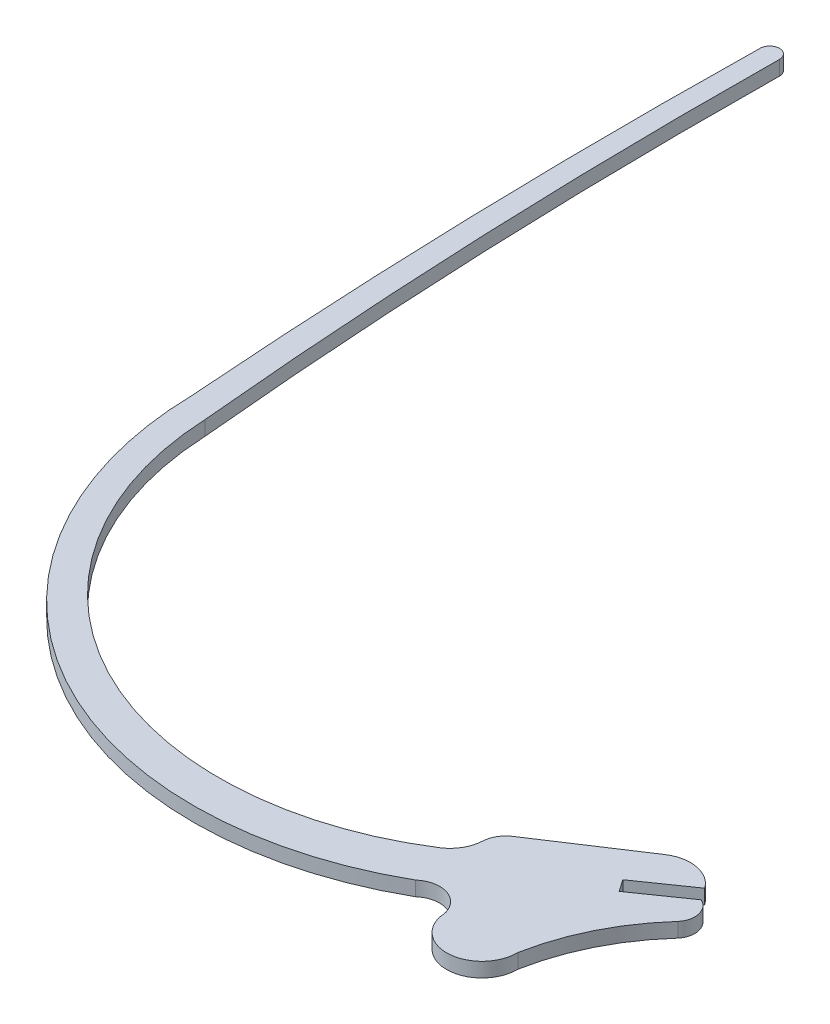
ISO-10303-21;
HEADER;
FILE_DESCRIPTION(('STEP AP214'),'2;1');
FILE_NAME('part.step','',(''),(''),'','','');
FILE_SCHEMA(('AUTOMOTIVE_DESIGN { 1 0 10303 214 1 1 1 1 }'));
ENDSEC;
DATA;
#1=APPLICATION_CONTEXT('core data for automotive mechanical design processes');
#2=APPLICATION_PROTOCOL_DEFINITION('international standard','automotive_design',2000,#1);
#3=PRODUCT_CONTEXT('',#1,'mechanical');
#4=PRODUCT('Part','Part','',(#3));
#5=PRODUCT_RELATED_PRODUCT_CATEGORY('part','',(#4));
#6=PRODUCT_DEFINITION_FORMATION('','',#4);
#7=PRODUCT_DEFINITION_CONTEXT('part definition',#1,'design');
#8=PRODUCT_DEFINITION('design','',#6,#7);
#9=PRODUCT_DEFINITION_SHAPE('','',#8);
#10=(LENGTH_UNIT() NAMED_UNIT(*) SI_UNIT(.MILLI.,.METRE.));
#11=(NAMED_UNIT(*) PLANE_ANGLE_UNIT() SI_UNIT($,.RADIAN.));
#12=(NAMED_UNIT(*) SI_UNIT($,.STERADIAN.) SOLID_ANGLE_UNIT());
#13=UNCERTAINTY_MEASURE_WITH_UNIT(LENGTH_MEASURE(1.E-05),#10,'distance_accuracy_value','');
#14=(GEOMETRIC_REPRESENTATION_CONTEXT(3) GLOBAL_UNCERTAINTY_ASSIGNED_CONTEXT((#13)) GLOBAL_UNIT_ASSIGNED_CONTEXT((#10,
#11,#12)) REPRESENTATION_CONTEXT('',''));
#15=CARTESIAN_POINT('',(0.,0.,0.));
#16=DIRECTION('',(0.,0.,1.));
#17=DIRECTION('',(1.,0.,0.));
#18=AXIS2_PLACEMENT_3D('',#15,#16,#17);
#19=CARTESIAN_POINT('',(-41670.167335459,3.,-18203.6307407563));
#20=DIRECTION('',(0.,-1.,0.));
#21=DIRECTION('',(0.,0.,-1.));
#22=AXIS2_PLACEMENT_3D('',#19,#20,#21);
#23=CYLINDRICAL_SURFACE('',#22,7.45711301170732);
#24=CARTESIAN_POINT('',(-41670.167335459,0.,-18203.6307407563));
#25=DIRECTION('',(0.,1.,0.));
#26=DIRECTION('',(0.,0.,1.));
#27=AXIS2_PLACEMENT_3D('',#24,#25,#26);
#28=CIRCLE('',#27,7.45711301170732);
#29=CARTESIAN_POINT('',(-41664.097656,0.,-18207.962891));
#30=VERTEX_POINT('',#29);
#31=CARTESIAN_POINT('',(-41674.261719,0.,-18209.863281));
#32=VERTEX_POINT('',#31);
#33=EDGE_CURVE('E186',#30,#32,#28,.T.);
#34=ORIENTED_EDGE('',*,*,#33,.T.);
#35=DIRECTION('',(0.,-1.,0.));
#36=VECTOR('',#35,1.);
#37=CARTESIAN_POINT('',(-41674.261719,3.,-18209.863281));
#38=LINE('',#37,#36);
#39=CARTESIAN_POINT('',(-41674.261719,3.,-18209.863281));
#40=VERTEX_POINT('',#39);
#41=EDGE_CURVE('E11',#40,#32,#38,.T.);
#42=ORIENTED_EDGE('',*,*,#41,.F.);
#43=CARTESIAN_POINT('',(-41670.167335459,3.,-18203.6307407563));
#44=DIRECTION('',(0.,1.,0.));
#45=DIRECTION('',(0.,0.,1.));
#46=AXIS2_PLACEMENT_3D('',#43,#44,#45);
#47=CIRCLE('',#46,7.45711301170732);
#48=CARTESIAN_POINT('',(-41664.097656,3.,-18207.962891));
#49=VERTEX_POINT('',#48);
#50=EDGE_CURVE('E218',#49,#40,#47,.T.);
#51=ORIENTED_EDGE('',*,*,#50,.F.);
#52=DIRECTION('',(0.,-1.,0.));
#53=VECTOR('',#52,1.);
#54=CARTESIAN_POINT('',(-41664.097656,3.,-18207.962891));
#55=LINE('',#54,#53);
#56=EDGE_CURVE('E182',#49,#30,#55,.T.);
#57=ORIENTED_EDGE('',*,*,#56,.T.);
#58=EDGE_LOOP('',(#34,#42,#51,#57));
#59=FACE_BOUND('',#58,.T.);
#60=ADVANCED_FACE('F36',(#59),#23,.T.);
#61=CARTESIAN_POINT('',(-41693.266504,3.,-18197.371175));
#62=DIRECTION('',(0.549277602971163,0.,0.835639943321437));
#63=DIRECTION('',(0.835639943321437,0.,-0.549277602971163));
#64=AXIS2_PLACEMENT_3D('',#61,#62,#63);
#65=PLANE('',#64);
#66=DIRECTION('',(-0.835639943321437,0.,0.549277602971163));
#67=VECTOR('',#66,1.);
#68=CARTESIAN_POINT('',(-41693.266504,0.,-18197.371175));
#69=LINE('',#68,#67);
#70=CARTESIAN_POINT('',(-41693.266504,0.,-18197.3711750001));
#71=VERTEX_POINT('',#70);
#72=EDGE_CURVE('E189',#32,#71,#69,.T.);
#73=ORIENTED_EDGE('',*,*,#72,.T.);
#74=DIRECTION('',(0.,-1.,0.));
#75=VECTOR('',#74,1.);
#76=CARTESIAN_POINT('',(-41693.266504,3.,-18197.3711750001));
#77=LINE('',#76,#75);
#78=CARTESIAN_POINT('',(-41693.266504,3.,-18197.3711750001));
#79=VERTEX_POINT('',#78);
#80=EDGE_CURVE('E44',#79,#71,#77,.T.);
#81=ORIENTED_EDGE('',*,*,#80,.F.);
#82=DIRECTION('',(-0.835639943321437,0.,0.549277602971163));
#83=VECTOR('',#82,1.);
#84=CARTESIAN_POINT('',(-41693.266504,3.,-18197.371175));
#85=LINE('',#84,#83);
#86=EDGE_CURVE('E122',#40,#79,#85,.T.);
#87=ORIENTED_EDGE('',*,*,#86,.F.);
#88=ORIENTED_EDGE('',*,*,#41,.T.);
#89=EDGE_LOOP('',(#73,#81,#87,#88));
#90=FACE_BOUND('',#89,.T.);
#91=ADVANCED_FACE('F321',(#90),#65,.F.);
#92=CARTESIAN_POINT('',(-41690.5203135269,3.,-18193.1919860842));
#93=DIRECTION('',(0.,-1.,0.));
#94=DIRECTION('',(0.,0.,-1.));
#95=AXIS2_PLACEMENT_3D('',#92,#93,#94);
#96=CYLINDRICAL_SURFACE('',#95,5.00071815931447);
#97=CARTESIAN_POINT('',(-41690.5203135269,0.,-18193.1919860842));
#98=DIRECTION('',(0.,1.,0.));
#99=DIRECTION('',(0.,0.,1.));
#100=AXIS2_PLACEMENT_3D('',#97,#98,#99);
#101=CIRCLE('',#100,5.00071815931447);
#102=CARTESIAN_POINT('',(-41695.515589,0.,-18193.425235));
#103=VERTEX_POINT('',#102);
#104=EDGE_CURVE('E191',#71,#103,#101,.T.);
#105=ORIENTED_EDGE('',*,*,#104,.T.);
#106=DIRECTION('',(0.,-1.,0.));
#107=VECTOR('',#106,1.);
#108=CARTESIAN_POINT('',(-41695.515589,3.,-18193.425235));
#109=LINE('',#108,#107);
#110=CARTESIAN_POINT('',(-41695.515589,3.,-18193.425235));
#111=VERTEX_POINT('',#110);
#112=EDGE_CURVE('E252',#111,#103,#109,.T.);
#113=ORIENTED_EDGE('',*,*,#112,.F.);
#114=CARTESIAN_POINT('',(-41690.5203135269,3.,-18193.1919860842));
#115=DIRECTION('',(0.,1.,0.));
#116=DIRECTION('',(0.,0.,1.));
#117=AXIS2_PLACEMENT_3D('',#114,#115,#116);
#118=CIRCLE('',#117,5.00071815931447);
#119=EDGE_CURVE('E260',#79,#111,#118,.T.);
#120=ORIENTED_EDGE('',*,*,#119,.F.);
#121=ORIENTED_EDGE('',*,*,#80,.T.);
#122=EDGE_LOOP('',(#105,#113,#120,#121));
#123=FACE_BOUND('',#122,.T.);
#124=ADVANCED_FACE('F258',(#123),#96,.T.);
#125=CARTESIAN_POINT('',(-41702.5818313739,3.,-18193.7542508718));
#126=DIRECTION('',(0.,-1.,0.));
#127=DIRECTION('',(0.,0.,-1.));
#128=AXIS2_PLACEMENT_3D('',#125,#126,#127);
#129=CYLINDRICAL_SURFACE('',#128,7.07389798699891);
#130=CARTESIAN_POINT('',(-41702.5818313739,0.,-18193.7542508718));
#131=DIRECTION('',(0.,-1.,0.));
#132=DIRECTION('',(0.,0.,1.));
#133=AXIS2_PLACEMENT_3D('',#130,#131,#132);
#134=CIRCLE('',#133,7.07389798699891);
#135=CARTESIAN_POINT('',(-41698.7770929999,0.,-18187.790695));
#136=VERTEX_POINT('',#135);
#137=EDGE_CURVE('E193',#103,#136,#134,.T.);
#138=ORIENTED_EDGE('',*,*,#137,.T.);
#139=DIRECTION('',(0.,-1.,0.));
#140=VECTOR('',#139,1.);
#141=CARTESIAN_POINT('',(-41698.7770929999,3.,-18187.790695));
#142=LINE('',#141,#140);
#143=CARTESIAN_POINT('',(-41698.7770929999,3.,-18187.790695));
#144=VERTEX_POINT('',#143);
#145=EDGE_CURVE('E249',#144,#136,#142,.T.);
#146=ORIENTED_EDGE('',*,*,#145,.F.);
#147=CARTESIAN_POINT('',(-41702.5818313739,3.,-18193.7542508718));
#148=DIRECTION('',(0.,-1.,0.));
#149=DIRECTION('',(0.,0.,1.));
#150=AXIS2_PLACEMENT_3D('',#147,#148,#149);
#151=CIRCLE('',#150,7.07389798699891);
#152=EDGE_CURVE('E278',#111,#144,#151,.T.);
#153=ORIENTED_EDGE('',*,*,#152,.F.);
#154=ORIENTED_EDGE('',*,*,#112,.T.);
#155=EDGE_LOOP('',(#138,#146,#153,#154));
#156=FACE_BOUND('',#155,.T.);
#157=ADVANCED_FACE('F269',(#156),#129,.F.);
#158=CARTESIAN_POINT('',(-41734.1210727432,3.,-18243.1972549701));
#159=DIRECTION('',(0.,-1.,0.));
#160=DIRECTION('',(0.,0.,-1.));
#161=AXIS2_PLACEMENT_3D('',#158,#159,#160);
#162=CYLINDRICAL_SURFACE('',#161,65.7197366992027);
#163=CARTESIAN_POINT('',(-41734.1210727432,0.,-18243.1972549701));
#164=DIRECTION('',(0.,-1.,0.));
#165=DIRECTION('',(0.,0.,1.));
#166=AXIS2_PLACEMENT_3D('',#163,#164,#165);
#167=CIRCLE('',#166,65.7197366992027);
#168=CARTESIAN_POINT('',(-41799.7722559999,0.,-18240.1962669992));
#169=VERTEX_POINT('',#168);
#170=EDGE_CURVE('E195',#136,#169,#167,.T.);
#171=ORIENTED_EDGE('',*,*,#170,.T.);
#172=DIRECTION('',(0.,-1.,0.));
#173=VECTOR('',#172,1.);
#174=CARTESIAN_POINT('',(-41799.7722559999,3.,-18240.1962669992));
#175=LINE('',#174,#173);
#176=CARTESIAN_POINT('',(-41799.7722559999,3.,-18240.1962669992));
#177=VERTEX_POINT('',#176);
#178=EDGE_CURVE('E246',#177,#169,#175,.T.);
#179=ORIENTED_EDGE('',*,*,#178,.F.);
#180=CARTESIAN_POINT('',(-41734.1210727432,3.,-18243.1972549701));
#181=DIRECTION('',(0.,-1.,0.));
#182=DIRECTION('',(0.,0.,1.));
#183=AXIS2_PLACEMENT_3D('',#180,#181,#182);
#184=CIRCLE('',#183,65.7197366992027);
#185=EDGE_CURVE('E275',#144,#177,#184,.T.);
#186=ORIENTED_EDGE('',*,*,#185,.F.);
#187=ORIENTED_EDGE('',*,*,#145,.T.);
#188=EDGE_LOOP('',(#171,#179,#186,#187));
#189=FACE_BOUND('',#188,.T.);
#190=ADVANCED_FACE('F273',(#189),#162,.F.);
#191=CARTESIAN_POINT('',(-40643.9922011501,3.,-18349.9280772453));
#192=DIRECTION('',(0.,-1.,0.));
#193=DIRECTION('',(0.,0.,-1.));
#194=AXIS2_PLACEMENT_3D('',#191,#192,#193);
#195=CYLINDRICAL_SURFACE('',#194,1160.97743534);
#196=CARTESIAN_POINT('',(-40643.9922011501,0.,-18349.9280772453));
#197=DIRECTION('',(0.,-1.,0.));
#198=DIRECTION('',(0.,0.,1.));
#199=AXIS2_PLACEMENT_3D('',#196,#197,#198);
#200=CIRCLE('',#199,1160.97743534);
#201=CARTESIAN_POINT('',(-41804.882129,0.,-18364.182227));
#202=VERTEX_POINT('',#201);
#203=EDGE_CURVE('E197',#169,#202,#200,.T.);
#204=ORIENTED_EDGE('',*,*,#203,.T.);
#205=DIRECTION('',(0.,-1.,0.));
#206=VECTOR('',#205,1.);
#207=CARTESIAN_POINT('',(-41804.882129,3.,-18364.182227));
#208=LINE('',#207,#206);
#209=CARTESIAN_POINT('',(-41804.882129,3.,-18364.182227));
#210=VERTEX_POINT('',#209);
#211=EDGE_CURVE('E243',#210,#202,#208,.T.);
#212=ORIENTED_EDGE('',*,*,#211,.F.);
#213=CARTESIAN_POINT('',(-40643.9922011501,3.,-18349.9280772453));
#214=DIRECTION('',(0.,-1.,0.));
#215=DIRECTION('',(0.,0.,1.));
#216=AXIS2_PLACEMENT_3D('',#213,#214,#215);
#217=CIRCLE('',#216,1160.97743534);
#218=EDGE_CURVE('E277',#177,#210,#217,.T.);
#219=ORIENTED_EDGE('',*,*,#218,.F.);
#220=ORIENTED_EDGE('',*,*,#178,.T.);
#221=EDGE_LOOP('',(#204,#212,#219,#220));
#222=FACE_BOUND('',#221,.T.);
#223=ADVANCED_FACE('F334',(#222),#195,.F.);
#224=CARTESIAN_POINT('',(-41806.879844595,3.,-18364.2070715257));
#225=DIRECTION('',(0.,-1.,0.));
#226=DIRECTION('',(0.,0.,-1.));
#227=AXIS2_PLACEMENT_3D('',#224,#225,#226);
#228=CYLINDRICAL_SURFACE('',#227,1.99787007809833);
#229=CARTESIAN_POINT('',(-41806.879844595,0.,-18364.2070715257));
#230=DIRECTION('',(0.,1.,0.));
#231=DIRECTION('',(0.,0.,1.));
#232=AXIS2_PLACEMENT_3D('',#229,#230,#231);
#233=CIRCLE('',#232,1.99787007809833);
#234=CARTESIAN_POINT('',(-41808.872267,0.,-18364.354509));
#235=VERTEX_POINT('',#234);
#236=EDGE_CURVE('E199',#202,#235,#233,.T.);
#237=ORIENTED_EDGE('',*,*,#236,.T.);
#238=DIRECTION('',(0.,-1.,0.));
#239=VECTOR('',#238,1.);
#240=CARTESIAN_POINT('',(-41808.872267,3.,-18364.354509));
#241=LINE('',#240,#239);
#242=CARTESIAN_POINT('',(-41808.872267,3.,-18364.354509));
#243=VERTEX_POINT('',#242);
#244=EDGE_CURVE('E240',#243,#235,#241,.T.);
#245=ORIENTED_EDGE('',*,*,#244,.F.);
#246=CARTESIAN_POINT('',(-41806.879844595,3.,-18364.2070715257));
#247=DIRECTION('',(0.,1.,0.));
#248=DIRECTION('',(0.,0.,1.));
#249=AXIS2_PLACEMENT_3D('',#246,#247,#248);
#250=CIRCLE('',#249,1.99787007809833);
#251=EDGE_CURVE('E280',#210,#243,#250,.T.);
#252=ORIENTED_EDGE('',*,*,#251,.F.);
#253=ORIENTED_EDGE('',*,*,#211,.T.);
#254=EDGE_LOOP('',(#237,#245,#252,#253));
#255=FACE_BOUND('',#254,.T.);
#256=ADVANCED_FACE('F337',(#255),#228,.T.);
#257=CARTESIAN_POINT('',(-40509.0392705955,3.,-18340.4780748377));
#258=DIRECTION('',(0.,-1.,0.));
#259=DIRECTION('',(0.,0.,-1.));
#260=AXIS2_PLACEMENT_3D('',#257,#258,#259);
#261=CYLINDRICAL_SURFACE('',#260,1300.0522691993);
#262=CARTESIAN_POINT('',(-40509.0392705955,0.,-18340.4780748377));
#263=DIRECTION('',(0.,1.,0.));
#264=DIRECTION('',(0.,0.,1.));
#265=AXIS2_PLACEMENT_3D('',#262,#263,#264);
#266=CIRCLE('',#265,1300.0522691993);
#267=CARTESIAN_POINT('',(-41805.442287,0.,-18243.1378379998));
#268=VERTEX_POINT('',#267);
#269=EDGE_CURVE('E201',#235,#268,#266,.T.);
#270=ORIENTED_EDGE('',*,*,#269,.T.);
#271=DIRECTION('',(0.,-1.,0.));
#272=VECTOR('',#271,1.);
#273=CARTESIAN_POINT('',(-41805.442287,3.,-18243.1378379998));
#274=LINE('',#273,#272);
#275=CARTESIAN_POINT('',(-41805.442287,3.,-18243.1378379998));
#276=VERTEX_POINT('',#275);
#277=EDGE_CURVE('E237',#276,#268,#274,.T.);
#278=ORIENTED_EDGE('',*,*,#277,.F.);
#279=CARTESIAN_POINT('',(-40509.0392705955,3.,-18340.4780748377));
#280=DIRECTION('',(0.,1.,0.));
#281=DIRECTION('',(0.,0.,1.));
#282=AXIS2_PLACEMENT_3D('',#279,#280,#281);
#283=CIRCLE('',#282,1300.0522691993);
#284=EDGE_CURVE('E286',#243,#276,#283,.T.);
#285=ORIENTED_EDGE('',*,*,#284,.F.);
#286=ORIENTED_EDGE('',*,*,#244,.T.);
#287=EDGE_LOOP('',(#270,#278,#285,#286));
#288=FACE_BOUND('',#287,.T.);
#289=ADVANCED_FACE('F341',(#288),#261,.T.);
#290=CARTESIAN_POINT('',(-41729.0621741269,3.,-18244.5690325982));
#291=DIRECTION('',(0.,-1.,0.));
#292=DIRECTION('',(0.,0.,-1.));
#293=AXIS2_PLACEMENT_3D('',#290,#291,#292);
#294=CYLINDRICAL_SURFACE('',#293,76.3935204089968);
#295=CARTESIAN_POINT('',(-41729.0621741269,0.,-18244.5690325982));
#296=DIRECTION('',(0.,1.,0.));
#297=DIRECTION('',(0.,0.,1.));
#298=AXIS2_PLACEMENT_3D('',#295,#296,#297);
#299=CIRCLE('',#298,76.3935204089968);
#300=CARTESIAN_POINT('',(-41796.8202680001,0.,-18209.2871580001));
#301=VERTEX_POINT('',#300);
#302=EDGE_CURVE('E203',#268,#301,#299,.T.);
#303=ORIENTED_EDGE('',*,*,#302,.T.);
#304=DIRECTION('',(0.,-1.,0.));
#305=VECTOR('',#304,1.);
#306=CARTESIAN_POINT('',(-41796.8202680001,3.,-18209.2871580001));
#307=LINE('',#306,#305);
#308=CARTESIAN_POINT('',(-41796.8202680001,3.,-18209.2871580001));
#309=VERTEX_POINT('',#308);
#310=EDGE_CURVE('E234',#309,#301,#307,.T.);
#311=ORIENTED_EDGE('',*,*,#310,.F.);
#312=CARTESIAN_POINT('',(-41729.0621741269,3.,-18244.5690325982));
#313=DIRECTION('',(0.,1.,0.));
#314=DIRECTION('',(0.,0.,1.));
#315=AXIS2_PLACEMENT_3D('',#312,#313,#314);
#316=CIRCLE('',#315,76.3935204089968);
#317=EDGE_CURVE('E288',#276,#309,#316,.T.);
#318=ORIENTED_EDGE('',*,*,#317,.F.);
#319=ORIENTED_EDGE('',*,*,#277,.T.);
#320=EDGE_LOOP('',(#303,#311,#318,#319));
#321=FACE_BOUND('',#320,.T.);
#322=ADVANCED_FACE('F345',(#321),#294,.T.);
#323=CARTESIAN_POINT('',(-41731.8291687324,3.,-18243.1292127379));
#324=DIRECTION('',(0.,-1.,0.));
#325=DIRECTION('',(0.,0.,-1.));
#326=AXIS2_PLACEMENT_3D('',#323,#324,#325);
#327=CYLINDRICAL_SURFACE('',#326,73.2743314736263);
#328=CARTESIAN_POINT('',(-41731.8291687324,0.,-18243.1292127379));
#329=DIRECTION('',(0.,1.,0.));
#330=DIRECTION('',(0.,0.,1.));
#331=AXIS2_PLACEMENT_3D('',#328,#329,#330);
#332=CIRCLE('',#331,73.2743314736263);
#333=CARTESIAN_POINT('',(-41695.481924,0.,-18179.5052749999));
#334=VERTEX_POINT('',#333);
#335=EDGE_CURVE('E205',#301,#334,#332,.T.);
#336=ORIENTED_EDGE('',*,*,#335,.T.);
#337=DIRECTION('',(0.,-1.,0.));
#338=VECTOR('',#337,1.);
#339=CARTESIAN_POINT('',(-41695.481924,3.,-18179.5052749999));
#340=LINE('',#339,#338);
#341=CARTESIAN_POINT('',(-41695.481924,3.,-18179.5052749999));
#342=VERTEX_POINT('',#341);
#343=EDGE_CURVE('E231',#342,#334,#340,.T.);
#344=ORIENTED_EDGE('',*,*,#343,.F.);
#345=CARTESIAN_POINT('',(-41731.8291687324,3.,-18243.1292127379));
#346=DIRECTION('',(0.,1.,0.));
#347=DIRECTION('',(0.,0.,1.));
#348=AXIS2_PLACEMENT_3D('',#345,#346,#347);
#349=CIRCLE('',#348,73.2743314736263);
#350=EDGE_CURVE('E290',#309,#342,#349,.T.);
#351=ORIENTED_EDGE('',*,*,#350,.F.);
#352=ORIENTED_EDGE('',*,*,#310,.T.);
#353=EDGE_LOOP('',(#336,#344,#351,#352));
#354=FACE_BOUND('',#353,.T.);
#355=ADVANCED_FACE('F349',(#354),#327,.T.);
#356=CARTESIAN_POINT('',(-41691.8619260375,3.,-18175.3744133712));
#357=DIRECTION('',(0.,-1.,0.));
#358=DIRECTION('',(0.,0.,-1.));
#359=AXIS2_PLACEMENT_3D('',#356,#357,#358);
#360=CYLINDRICAL_SURFACE('',#359,5.49257708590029);
#361=CARTESIAN_POINT('',(-41691.8619260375,0.,-18175.3744133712));
#362=DIRECTION('',(0.,-1.,0.));
#363=DIRECTION('',(0.,0.,1.));
#364=AXIS2_PLACEMENT_3D('',#361,#362,#363);
#365=CIRCLE('',#364,5.49257708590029);
#366=CARTESIAN_POINT('',(-41686.3725320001,0.,-18175.561379));
#367=VERTEX_POINT('',#366);
#368=EDGE_CURVE('E207',#334,#367,#365,.T.);
#369=ORIENTED_EDGE('',*,*,#368,.T.);
#370=DIRECTION('',(0.,-1.,0.));
#371=VECTOR('',#370,1.);
#372=CARTESIAN_POINT('',(-41686.3725320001,3.,-18175.561379));
#373=LINE('',#372,#371);
#374=CARTESIAN_POINT('',(-41686.3725320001,3.,-18175.561379));
#375=VERTEX_POINT('',#374);
#376=EDGE_CURVE('E228',#375,#367,#373,.T.);
#377=ORIENTED_EDGE('',*,*,#376,.F.);
#378=CARTESIAN_POINT('',(-41691.8619260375,3.,-18175.3744133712));
#379=DIRECTION('',(0.,-1.,0.));
#380=DIRECTION('',(0.,0.,1.));
#381=AXIS2_PLACEMENT_3D('',#378,#379,#380);
#382=CIRCLE('',#381,5.49257708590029);
#383=EDGE_CURVE('E292',#342,#375,#382,.T.);
#384=ORIENTED_EDGE('',*,*,#383,.F.);
#385=ORIENTED_EDGE('',*,*,#343,.T.);
#386=EDGE_LOOP('',(#369,#377,#384,#385));
#387=FACE_BOUND('',#386,.T.);
#388=ADVANCED_FACE('F353',(#387),#360,.F.);
#389=CARTESIAN_POINT('',(-41679.2044723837,3.,-18176.9783732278));
#390=DIRECTION('',(0.,-1.,0.));
#391=DIRECTION('',(0.,0.,-1.));
#392=AXIS2_PLACEMENT_3D('',#389,#390,#391);
#393=CYLINDRICAL_SURFACE('',#392,7.30677434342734);
#394=CARTESIAN_POINT('',(-41679.2044723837,0.,-18176.9783732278));
#395=DIRECTION('',(0.,1.,0.));
#396=DIRECTION('',(0.,0.,1.));
#397=AXIS2_PLACEMENT_3D('',#394,#395,#396);
#398=CIRCLE('',#397,7.30677434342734);
#399=CARTESIAN_POINT('',(-41671.89863,0.,-18177.095071));
#400=VERTEX_POINT('',#399);
#401=EDGE_CURVE('E209',#367,#400,#398,.T.);
#402=ORIENTED_EDGE('',*,*,#401,.T.);
#403=DIRECTION('',(0.,-1.,0.));
#404=VECTOR('',#403,1.);
#405=CARTESIAN_POINT('',(-41671.89863,3.,-18177.095071));
#406=LINE('',#405,#404);
#407=CARTESIAN_POINT('',(-41671.89863,3.,-18177.095071));
#408=VERTEX_POINT('',#407);
#409=EDGE_CURVE('E225',#408,#400,#406,.T.);
#410=ORIENTED_EDGE('',*,*,#409,.F.);
#411=CARTESIAN_POINT('',(-41679.2044723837,3.,-18176.9783732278));
#412=DIRECTION('',(0.,1.,0.));
#413=DIRECTION('',(0.,0.,1.));
#414=AXIS2_PLACEMENT_3D('',#411,#412,#413);
#415=CIRCLE('',#414,7.30677434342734);
#416=EDGE_CURVE('E294',#375,#408,#415,.T.);
#417=ORIENTED_EDGE('',*,*,#416,.F.);
#418=ORIENTED_EDGE('',*,*,#376,.T.);
#419=EDGE_LOOP('',(#402,#410,#417,#418));
#420=FACE_BOUND('',#419,.T.);
#421=ADVANCED_FACE('F357',(#420),#393,.T.);
#422=CARTESIAN_POINT('',(-41627.4001644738,3.,-18168.8129219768));
#423=DIRECTION('',(0.,-1.,0.));
#424=DIRECTION('',(0.,0.,-1.));
#425=AXIS2_PLACEMENT_3D('',#422,#423,#424);
#426=CYLINDRICAL_SURFACE('',#425,45.2626493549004);
#427=CARTESIAN_POINT('',(-41627.4001644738,0.,-18168.8129219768));
#428=DIRECTION('',(0.,-1.,0.));
#429=DIRECTION('',(0.,0.,1.));
#430=AXIS2_PLACEMENT_3D('',#427,#428,#429);
#431=CIRCLE('',#430,45.2626493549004);
#432=CARTESIAN_POINT('',(-41660.929052,0.,-18199.218861));
#433=VERTEX_POINT('',#432);
#434=EDGE_CURVE('E211',#400,#433,#431,.T.);
#435=ORIENTED_EDGE('',*,*,#434,.T.);
#436=DIRECTION('',(0.,-1.,0.));
#437=VECTOR('',#436,1.);
#438=CARTESIAN_POINT('',(-41660.929052,3.,-18199.218861));
#439=LINE('',#438,#437);
#440=CARTESIAN_POINT('',(-41660.929052,3.,-18199.218861));
#441=VERTEX_POINT('',#440);
#442=EDGE_CURVE('E222',#441,#433,#439,.T.);
#443=ORIENTED_EDGE('',*,*,#442,.F.);
#444=CARTESIAN_POINT('',(-41627.4001644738,3.,-18168.8129219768));
#445=DIRECTION('',(0.,-1.,0.));
#446=DIRECTION('',(0.,0.,1.));
#447=AXIS2_PLACEMENT_3D('',#444,#445,#446);
#448=CIRCLE('',#447,45.2626493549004);
#449=EDGE_CURVE('E296',#408,#441,#448,.T.);
#450=ORIENTED_EDGE('',*,*,#449,.F.);
#451=ORIENTED_EDGE('',*,*,#409,.T.);
#452=EDGE_LOOP('',(#435,#443,#450,#451));
#453=FACE_BOUND('',#452,.T.);
#454=ADVANCED_FACE('F302',(#453),#426,.F.);
#455=CARTESIAN_POINT('',(-41664.0234637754,3.,-18201.8126157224));
#456=DIRECTION('',(0.,-1.,0.));
#457=DIRECTION('',(0.,0.,-1.));
#458=AXIS2_PLACEMENT_3D('',#455,#456,#457);
#459=CYLINDRICAL_SURFACE('',#458,4.03769089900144);
#460=CARTESIAN_POINT('',(-41664.0234637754,0.,-18201.8126157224));
#461=DIRECTION('',(0.,1.,0.));
#462=DIRECTION('',(0.,0.,1.));
#463=AXIS2_PLACEMENT_3D('',#460,#461,#462);
#464=CIRCLE('',#463,4.03769089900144);
#465=CARTESIAN_POINT('',(-41662.382812,0.,-18205.501953));
#466=VERTEX_POINT('',#465);
#467=EDGE_CURVE('E213',#433,#466,#464,.T.);
#468=ORIENTED_EDGE('',*,*,#467,.T.);
#469=DIRECTION('',(0.,-1.,0.));
#470=VECTOR('',#469,1.);
#471=CARTESIAN_POINT('',(-41662.382812,3.,-18205.501953));
#472=LINE('',#471,#470);
#473=CARTESIAN_POINT('',(-41662.382812,3.,-18205.501953));
#474=VERTEX_POINT('',#473);
#475=EDGE_CURVE('E177',#474,#466,#472,.T.);
#476=ORIENTED_EDGE('',*,*,#475,.F.);
#477=CARTESIAN_POINT('',(-41664.0234637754,3.,-18201.8126157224));
#478=DIRECTION('',(0.,1.,0.));
#479=DIRECTION('',(0.,0.,1.));
#480=AXIS2_PLACEMENT_3D('',#477,#478,#479);
#481=CIRCLE('',#480,4.03769089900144);
#482=EDGE_CURVE('E168',#441,#474,#481,.T.);
#483=ORIENTED_EDGE('',*,*,#482,.F.);
#484=ORIENTED_EDGE('',*,*,#442,.T.);
#485=EDGE_LOOP('',(#468,#476,#483,#484));
#486=FACE_BOUND('',#485,.T.);
#487=ADVANCED_FACE('F306',(#486),#459,.T.);
#488=CARTESIAN_POINT('',(-41672.375,3.,-18198.541016));
#489=DIRECTION('',(0.571609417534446,0.,0.820525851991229));
#490=DIRECTION('',(0.820525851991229,0.,-0.571609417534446));
#491=AXIS2_PLACEMENT_3D('',#488,#489,#490);
#492=PLANE('',#491);
#493=DIRECTION('',(-0.820525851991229,0.,0.571609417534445));
#494=VECTOR('',#493,1.);
#495=CARTESIAN_POINT('',(-41672.375,0.,-18198.541016));
#496=LINE('',#495,#494);
#497=CARTESIAN_POINT('',(-41672.375,0.,-18198.541016));
#498=VERTEX_POINT('',#497);
#499=EDGE_CURVE('E176',#466,#498,#496,.T.);
#500=ORIENTED_EDGE('',*,*,#499,.T.);
#501=DIRECTION('',(0.,-1.,0.));
#502=VECTOR('',#501,1.);
#503=CARTESIAN_POINT('',(-41672.375,3.,-18198.541016));
#504=LINE('',#503,#502);
#505=CARTESIAN_POINT('',(-41672.375,3.,-18198.541016));
#506=VERTEX_POINT('',#505);
#507=EDGE_CURVE('E173',#506,#498,#504,.T.);
#508=ORIENTED_EDGE('',*,*,#507,.F.);
#509=DIRECTION('',(-0.820525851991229,0.,0.571609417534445));
#510=VECTOR('',#509,1.);
#511=CARTESIAN_POINT('',(-41672.375,3.,-18198.541016));
#512=LINE('',#511,#510);
#513=EDGE_CURVE('E162',#474,#506,#512,.T.);
#514=ORIENTED_EDGE('',*,*,#513,.F.);
#515=ORIENTED_EDGE('',*,*,#475,.T.);
#516=EDGE_LOOP('',(#500,#508,#514,#515));
#517=FACE_BOUND('',#516,.T.);
#518=ADVANCED_FACE('F174',(#517),#492,.F.);
#519=CARTESIAN_POINT('',(-41674.089844,3.,-18201.003906));
#520=DIRECTION('',(-0.82066625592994,0.,0.571407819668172));
#521=DIRECTION('',(0.571407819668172,0.,0.82066625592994));
#522=AXIS2_PLACEMENT_3D('',#519,#520,#521);
#523=PLANE('',#522);
#524=DIRECTION('',(-0.571407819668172,0.,-0.82066625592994));
#525=VECTOR('',#524,1.);
#526=CARTESIAN_POINT('',(-41674.089844,0.,-18201.003906));
#527=LINE('',#526,#525);
#528=CARTESIAN_POINT('',(-41674.089844,0.,-18201.003906));
#529=VERTEX_POINT('',#528);
#530=EDGE_CURVE('E108',#498,#529,#527,.T.);
#531=ORIENTED_EDGE('',*,*,#530,.T.);
#532=DIRECTION('',(0.,-1.,0.));
#533=VECTOR('',#532,1.);
#534=CARTESIAN_POINT('',(-41674.089844,3.,-18201.003906));
#535=LINE('',#534,#533);
#536=CARTESIAN_POINT('',(-41674.089844,3.,-18201.003906));
#537=VERTEX_POINT('',#536);
#538=EDGE_CURVE('E178',#537,#529,#535,.T.);
#539=ORIENTED_EDGE('',*,*,#538,.F.);
#540=DIRECTION('',(-0.571407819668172,0.,-0.82066625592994));
#541=VECTOR('',#540,1.);
#542=CARTESIAN_POINT('',(-41674.089844,3.,-18201.003906));
#543=LINE('',#542,#541);
#544=EDGE_CURVE('E166',#506,#537,#543,.T.);
#545=ORIENTED_EDGE('',*,*,#544,.F.);
#546=ORIENTED_EDGE('',*,*,#507,.T.);
#547=EDGE_LOOP('',(#531,#539,#545,#546));
#548=FACE_BOUND('',#547,.T.);
#549=ADVANCED_FACE('F180',(#548),#523,.F.);
#550=CARTESIAN_POINT('',(-41664.097656,3.,-18207.962891));
#551=DIRECTION('',(-0.571501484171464,0.,-0.820601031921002));
#552=DIRECTION('',(-0.820601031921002,0.,0.571501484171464));
#553=AXIS2_PLACEMENT_3D('',#550,#551,#552);
#554=PLANE('',#553);
#555=DIRECTION('',(0.820601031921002,0.,-0.571501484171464));
#556=VECTOR('',#555,1.);
#557=CARTESIAN_POINT('',(-41664.097656,0.,-18207.962891));
#558=LINE('',#557,#556);
#559=EDGE_CURVE('E114',#529,#30,#558,.T.);
#560=ORIENTED_EDGE('',*,*,#559,.T.);
#561=ORIENTED_EDGE('',*,*,#56,.F.);
#562=DIRECTION('',(0.820601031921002,0.,-0.571501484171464));
#563=VECTOR('',#562,1.);
#564=CARTESIAN_POINT('',(-41664.097656,3.,-18207.962891));
#565=LINE('',#564,#563);
#566=EDGE_CURVE('E52',#537,#49,#565,.T.);
#567=ORIENTED_EDGE('',*,*,#566,.F.);
#568=ORIENTED_EDGE('',*,*,#538,.T.);
#569=EDGE_LOOP('',(#560,#561,#567,#568));
#570=FACE_BOUND('',#569,.T.);
#571=ADVANCED_FACE('F310',(#570),#554,.F.);
#572=CARTESIAN_POINT('',(-41670.167335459,3.,-18203.6307407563));
#573=DIRECTION('',(0.,1.,0.));
#574=DIRECTION('',(0.,0.,1.));
#575=AXIS2_PLACEMENT_3D('',#572,#573,#574);
#576=PLANE('',#575);
#577=ORIENTED_EDGE('',*,*,#50,.T.);
#578=ORIENTED_EDGE('',*,*,#86,.T.);
#579=ORIENTED_EDGE('',*,*,#119,.T.);
#580=ORIENTED_EDGE('',*,*,#152,.T.);
#581=ORIENTED_EDGE('',*,*,#185,.T.);
#582=ORIENTED_EDGE('',*,*,#218,.T.);
#583=ORIENTED_EDGE('',*,*,#251,.T.);
#584=ORIENTED_EDGE('',*,*,#284,.T.);
#585=ORIENTED_EDGE('',*,*,#317,.T.);
#586=ORIENTED_EDGE('',*,*,#350,.T.);
#587=ORIENTED_EDGE('',*,*,#383,.T.);
#588=ORIENTED_EDGE('',*,*,#416,.T.);
#589=ORIENTED_EDGE('',*,*,#449,.T.);
#590=ORIENTED_EDGE('',*,*,#482,.T.);
#591=ORIENTED_EDGE('',*,*,#513,.T.);
#592=ORIENTED_EDGE('',*,*,#544,.T.);
#593=ORIENTED_EDGE('',*,*,#566,.T.);
#594=EDGE_LOOP('',(#577,#578,#579,#580,#581,#582,#583,#584,#585,#586,#587,#588,#589,#590,#591,
#592,#593));
#595=FACE_BOUND('',#594,.T.);
#596=ADVANCED_FACE('F164',(#595),#576,.T.);
#597=CARTESIAN_POINT('',(-41670.167335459,0.,-18203.6307407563));
#598=DIRECTION('',(0.,1.,0.));
#599=DIRECTION('',(0.,0.,1.));
#600=AXIS2_PLACEMENT_3D('',#597,#598,#599);
#601=PLANE('',#600);
#602=ORIENTED_EDGE('',*,*,#33,.F.);
#603=ORIENTED_EDGE('',*,*,#559,.F.);
#604=ORIENTED_EDGE('',*,*,#530,.F.);
#605=ORIENTED_EDGE('',*,*,#499,.F.);
#606=ORIENTED_EDGE('',*,*,#467,.F.);
#607=ORIENTED_EDGE('',*,*,#434,.F.);
#608=ORIENTED_EDGE('',*,*,#401,.F.);
#609=ORIENTED_EDGE('',*,*,#368,.F.);
#610=ORIENTED_EDGE('',*,*,#335,.F.);
#611=ORIENTED_EDGE('',*,*,#302,.F.);
#612=ORIENTED_EDGE('',*,*,#269,.F.);
#613=ORIENTED_EDGE('',*,*,#236,.F.);
#614=ORIENTED_EDGE('',*,*,#203,.F.);
#615=ORIENTED_EDGE('',*,*,#170,.F.);
#616=ORIENTED_EDGE('',*,*,#137,.F.);
#617=ORIENTED_EDGE('',*,*,#104,.F.);
#618=ORIENTED_EDGE('',*,*,#72,.F.);
#619=EDGE_LOOP('',(#602,#603,#604,#605,#606,#607,#608,#609,#610,#611,#612,#613,#614,#615,#616,
#617,#618));
#620=FACE_BOUND('',#619,.T.);
#621=ADVANCED_FACE('F264',(#620),#601,.F.);
#622=CLOSED_SHELL('',(#60,#91,#124,#157,#190,#223,#256,#289,#322,#355,#388,#421,#454,#487,#518,
#549,#571,#596,#621));
#623=MANIFOLD_SOLID_BREP('B2',#622);
#624=ADVANCED_BREP_SHAPE_REPRESENTATION('',(#18,#623),#14);
#625=SHAPE_DEFINITION_REPRESENTATION(#9,#624);
ENDSEC;
END-ISO-10303-21;
